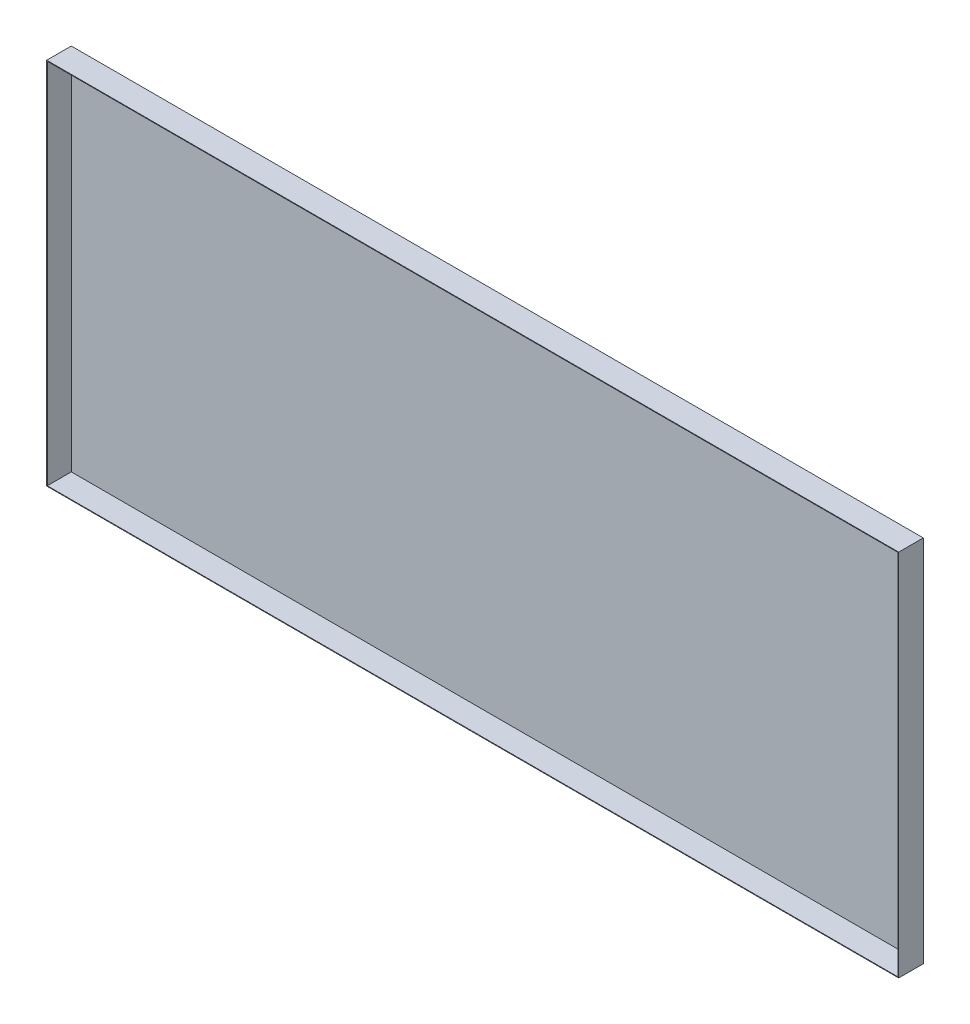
ISO-10303-21;
HEADER;
FILE_DESCRIPTION(('STEP AP214'),'2;1');
FILE_NAME('part.step','',(''),(''),'','','');
FILE_SCHEMA(('AUTOMOTIVE_DESIGN { 1 0 10303 214 1 1 1 1 }'));
ENDSEC;
DATA;
#1=APPLICATION_CONTEXT('core data for automotive mechanical design processes');
#2=APPLICATION_PROTOCOL_DEFINITION('international standard','automotive_design',2000,#1);
#3=PRODUCT_CONTEXT('',#1,'mechanical');
#4=PRODUCT('Part','Part','',(#3));
#5=PRODUCT_RELATED_PRODUCT_CATEGORY('part','',(#4));
#6=PRODUCT_DEFINITION_FORMATION('','',#4);
#7=PRODUCT_DEFINITION_CONTEXT('part definition',#1,'design');
#8=PRODUCT_DEFINITION('design','',#6,#7);
#9=PRODUCT_DEFINITION_SHAPE('','',#8);
#10=(LENGTH_UNIT() NAMED_UNIT(*) SI_UNIT(.MILLI.,.METRE.));
#11=(NAMED_UNIT(*) PLANE_ANGLE_UNIT() SI_UNIT($,.RADIAN.));
#12=(NAMED_UNIT(*) SI_UNIT($,.STERADIAN.) SOLID_ANGLE_UNIT());
#13=UNCERTAINTY_MEASURE_WITH_UNIT(LENGTH_MEASURE(1.E-05),#10,'distance_accuracy_value','');
#14=(GEOMETRIC_REPRESENTATION_CONTEXT(3) GLOBAL_UNCERTAINTY_ASSIGNED_CONTEXT((#13)) GLOBAL_UNIT_ASSIGNED_CONTEXT((#10,
#11,#12)) REPRESENTATION_CONTEXT('',''));
#15=CARTESIAN_POINT('',(0.,0.,0.));
#16=DIRECTION('',(0.,0.,1.));
#17=DIRECTION('',(1.,0.,0.));
#18=AXIS2_PLACEMENT_3D('',#15,#16,#17);
#19=CARTESIAN_POINT('',(693.,-600.,40.));
#20=DIRECTION('',(-1.,0.,0.));
#21=DIRECTION('',(0.,-1.,0.));
#22=AXIS2_PLACEMENT_3D('',#19,#20,#21);
#23=PLANE('',#22);
#24=DIRECTION('',(0.,1.,0.));
#25=VECTOR('',#24,1.);
#26=CARTESIAN_POINT('',(693.,-600.,0.));
#27=LINE('',#26,#25);
#28=CARTESIAN_POINT('',(693.,-600.,0.));
#29=VERTEX_POINT('',#28);
#30=CARTESIAN_POINT('',(693.,0.,0.));
#31=VERTEX_POINT('',#30);
#32=EDGE_CURVE('E447',#29,#31,#27,.T.);
#33=ORIENTED_EDGE('',*,*,#32,.T.);
#34=DIRECTION('',(0.,0.,-1.));
#35=VECTOR('',#34,1.);
#36=CARTESIAN_POINT('',(693.,0.,40.));
#37=LINE('',#36,#35);
#38=CARTESIAN_POINT('',(693.,0.,40.));
#39=VERTEX_POINT('',#38);
#40=EDGE_CURVE('E11',#39,#31,#37,.T.);
#41=ORIENTED_EDGE('',*,*,#40,.F.);
#42=DIRECTION('',(0.,1.,0.));
#43=VECTOR('',#42,1.);
#44=CARTESIAN_POINT('',(693.,-600.,40.));
#45=LINE('',#44,#43);
#46=CARTESIAN_POINT('',(693.,-600.,40.));
#47=VERTEX_POINT('',#46);
#48=EDGE_CURVE('E456',#47,#39,#45,.T.);
#49=ORIENTED_EDGE('',*,*,#48,.F.);
#50=DIRECTION('',(0.,0.,-1.));
#51=VECTOR('',#50,1.);
#52=CARTESIAN_POINT('',(693.,-600.,40.));
#53=LINE('',#52,#51);
#54=EDGE_CURVE('E463',#47,#29,#53,.T.);
#55=ORIENTED_EDGE('',*,*,#54,.T.);
#56=EDGE_LOOP('',(#33,#41,#49,#55));
#57=FACE_BOUND('',#56,.T.);
#58=ADVANCED_FACE('F348',(#57),#23,.F.);
#59=CARTESIAN_POINT('',(693.,0.,40.));
#60=DIRECTION('',(0.,-1.,0.));
#61=DIRECTION('',(1.,0.,0.));
#62=AXIS2_PLACEMENT_3D('',#59,#60,#61);
#63=PLANE('',#62);
#64=DIRECTION('',(-1.,0.,0.));
#65=VECTOR('',#64,1.);
#66=CARTESIAN_POINT('',(693.,0.,0.));
#67=LINE('',#66,#65);
#68=CARTESIAN_POINT('',(-693.,-1.76669334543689E-13,0.));
#69=VERTEX_POINT('',#68);
#70=EDGE_CURVE('E450',#31,#69,#67,.T.);
#71=ORIENTED_EDGE('',*,*,#70,.T.);
#72=DIRECTION('',(0.,0.,-1.));
#73=VECTOR('',#72,1.);
#74=CARTESIAN_POINT('',(-693.,-1.76669334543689E-13,40.));
#75=LINE('',#74,#73);
#76=CARTESIAN_POINT('',(-693.,-1.76669334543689E-13,40.));
#77=VERTEX_POINT('',#76);
#78=EDGE_CURVE('E355',#77,#69,#75,.T.);
#79=ORIENTED_EDGE('',*,*,#78,.F.);
#80=DIRECTION('',(-1.,0.,0.));
#81=VECTOR('',#80,1.);
#82=CARTESIAN_POINT('',(693.,0.,40.));
#83=LINE('',#82,#81);
#84=EDGE_CURVE('E458',#39,#77,#83,.T.);
#85=ORIENTED_EDGE('',*,*,#84,.F.);
#86=ORIENTED_EDGE('',*,*,#40,.T.);
#87=EDGE_LOOP('',(#71,#79,#85,#86));
#88=FACE_BOUND('',#87,.T.);
#89=ADVANCED_FACE('F486',(#88),#63,.F.);
#90=CARTESIAN_POINT('',(-693.,-600.,40.));
#91=DIRECTION('',(1.,0.,0.));
#92=DIRECTION('',(0.,0.,-1.));
#93=AXIS2_PLACEMENT_3D('',#90,#91,#92);
#94=PLANE('',#93);
#95=DIRECTION('',(0.,-1.,0.));
#96=VECTOR('',#95,1.);
#97=CARTESIAN_POINT('',(-693.,-600.,0.));
#98=LINE('',#97,#96);
#99=CARTESIAN_POINT('',(-693.,-600.,0.));
#100=VERTEX_POINT('',#99);
#101=EDGE_CURVE('E452',#69,#100,#98,.T.);
#102=ORIENTED_EDGE('',*,*,#101,.T.);
#103=DIRECTION('',(0.,0.,-1.));
#104=VECTOR('',#103,1.);
#105=CARTESIAN_POINT('',(-693.,-600.,40.));
#106=LINE('',#105,#104);
#107=CARTESIAN_POINT('',(-693.,-600.,40.));
#108=VERTEX_POINT('',#107);
#109=EDGE_CURVE('E466',#108,#100,#106,.T.);
#110=ORIENTED_EDGE('',*,*,#109,.F.);
#111=DIRECTION('',(0.,-1.,0.));
#112=VECTOR('',#111,1.);
#113=CARTESIAN_POINT('',(-693.,-600.,40.));
#114=LINE('',#113,#112);
#115=EDGE_CURVE('E460',#77,#108,#114,.T.);
#116=ORIENTED_EDGE('',*,*,#115,.F.);
#117=ORIENTED_EDGE('',*,*,#78,.T.);
#118=EDGE_LOOP('',(#102,#110,#116,#117));
#119=FACE_BOUND('',#118,.T.);
#120=ADVANCED_FACE('F473',(#119),#94,.F.);
#121=CARTESIAN_POINT('',(693.,-600.,40.));
#122=DIRECTION('',(0.,1.,0.));
#123=DIRECTION('',(-1.,0.,0.));
#124=AXIS2_PLACEMENT_3D('',#121,#122,#123);
#125=PLANE('',#124);
#126=DIRECTION('',(1.,0.,0.));
#127=VECTOR('',#126,1.);
#128=CARTESIAN_POINT('',(693.,-600.,0.));
#129=LINE('',#128,#127);
#130=EDGE_CURVE('E454',#100,#29,#129,.T.);
#131=ORIENTED_EDGE('',*,*,#130,.T.);
#132=ORIENTED_EDGE('',*,*,#54,.F.);
#133=DIRECTION('',(1.,0.,0.));
#134=VECTOR('',#133,1.);
#135=CARTESIAN_POINT('',(693.,-600.,40.));
#136=LINE('',#135,#134);
#137=EDGE_CURVE('E370',#108,#47,#136,.T.);
#138=ORIENTED_EDGE('',*,*,#137,.F.);
#139=ORIENTED_EDGE('',*,*,#109,.T.);
#140=EDGE_LOOP('',(#131,#132,#138,#139));
#141=FACE_BOUND('',#140,.T.);
#142=ADVANCED_FACE('F481',(#141),#125,.F.);
#143=CARTESIAN_POINT('',(693.,-600.,40.));
#144=DIRECTION('',(0.,0.,1.));
#145=DIRECTION('',(1.,0.,0.));
#146=AXIS2_PLACEMENT_3D('',#143,#144,#145);
#147=PLANE('',#146);
#148=DIRECTION('',(0.,1.,0.));
#149=VECTOR('',#148,1.);
#150=CARTESIAN_POINT('',(692.,-600.,40.));
#151=LINE('',#150,#149);
#152=CARTESIAN_POINT('',(692.,-599.,40.));
#153=VERTEX_POINT('',#152);
#154=CARTESIAN_POINT('',(692.,-1.00000000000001,40.));
#155=VERTEX_POINT('',#154);
#156=EDGE_CURVE('E436',#153,#155,#151,.T.);
#157=ORIENTED_EDGE('',*,*,#156,.F.);
#158=DIRECTION('',(1.,0.,0.));
#159=VECTOR('',#158,1.);
#160=CARTESIAN_POINT('',(693.,-599.,40.));
#161=LINE('',#160,#159);
#162=CARTESIAN_POINT('',(-692.,-599.,40.));
#163=VERTEX_POINT('',#162);
#164=EDGE_CURVE('E445',#163,#153,#161,.T.);
#165=ORIENTED_EDGE('',*,*,#164,.F.);
#166=DIRECTION('',(0.,-1.,0.));
#167=VECTOR('',#166,1.);
#168=CARTESIAN_POINT('',(-692.,-600.,40.));
#169=LINE('',#168,#167);
#170=CARTESIAN_POINT('',(-692.,-1.00000000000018,40.));
#171=VERTEX_POINT('',#170);
#172=EDGE_CURVE('E443',#171,#163,#169,.T.);
#173=ORIENTED_EDGE('',*,*,#172,.F.);
#174=DIRECTION('',(-1.,0.,0.));
#175=VECTOR('',#174,1.);
#176=CARTESIAN_POINT('',(693.,-1.00000000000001,40.));
#177=LINE('',#176,#175);
#178=EDGE_CURVE('E428',#155,#171,#177,.T.);
#179=ORIENTED_EDGE('',*,*,#178,.F.);
#180=EDGE_LOOP('',(#157,#165,#173,#179));
#181=FACE_BOUND('',#180,.T.);
#182=ORIENTED_EDGE('',*,*,#48,.T.);
#183=ORIENTED_EDGE('',*,*,#84,.T.);
#184=ORIENTED_EDGE('',*,*,#115,.T.);
#185=ORIENTED_EDGE('',*,*,#137,.T.);
#186=EDGE_LOOP('',(#182,#183,#184,#185));
#187=FACE_BOUND('',#186,.T.);
#188=ADVANCED_FACE('F485',(#181,#187),#147,.T.);
#189=CARTESIAN_POINT('',(693.,-600.,0.));
#190=DIRECTION('',(0.,0.,1.));
#191=DIRECTION('',(1.,0.,0.));
#192=AXIS2_PLACEMENT_3D('',#189,#190,#191);
#193=PLANE('',#192);
#194=ORIENTED_EDGE('',*,*,#32,.F.);
#195=ORIENTED_EDGE('',*,*,#130,.F.);
#196=ORIENTED_EDGE('',*,*,#101,.F.);
#197=ORIENTED_EDGE('',*,*,#70,.F.);
#198=EDGE_LOOP('',(#194,#195,#196,#197));
#199=FACE_BOUND('',#198,.T.);
#200=ADVANCED_FACE('F479',(#199),#193,.F.);
#201=CARTESIAN_POINT('',(692.,-600.,40.));
#202=DIRECTION('',(-1.,0.,0.));
#203=DIRECTION('',(0.,-1.,0.));
#204=AXIS2_PLACEMENT_3D('',#201,#202,#203);
#205=PLANE('',#204);
#206=DIRECTION('',(0.,1.,0.));
#207=VECTOR('',#206,1.);
#208=CARTESIAN_POINT('',(692.,-600.,1.));
#209=LINE('',#208,#207);
#210=CARTESIAN_POINT('',(692.,-599.,1.));
#211=VERTEX_POINT('',#210);
#212=CARTESIAN_POINT('',(692.,-1.00000000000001,1.));
#213=VERTEX_POINT('',#212);
#214=EDGE_CURVE('E419',#211,#213,#209,.T.);
#215=ORIENTED_EDGE('',*,*,#214,.F.);
#216=DIRECTION('',(0.,0.,-1.));
#217=VECTOR('',#216,1.);
#218=CARTESIAN_POINT('',(692.,-599.,40.));
#219=LINE('',#218,#217);
#220=EDGE_CURVE('E439',#153,#211,#219,.T.);
#221=ORIENTED_EDGE('',*,*,#220,.F.);
#222=ORIENTED_EDGE('',*,*,#156,.T.);
#223=DIRECTION('',(0.,0.,-1.));
#224=VECTOR('',#223,1.);
#225=CARTESIAN_POINT('',(692.,-1.00000000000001,40.));
#226=LINE('',#225,#224);
#227=EDGE_CURVE('E431',#155,#213,#226,.T.);
#228=ORIENTED_EDGE('',*,*,#227,.T.);
#229=EDGE_LOOP('',(#215,#221,#222,#228));
#230=FACE_BOUND('',#229,.T.);
#231=ADVANCED_FACE('F501',(#230),#205,.T.);
#232=CARTESIAN_POINT('',(693.,-1.00000000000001,40.));
#233=DIRECTION('',(0.,-1.,0.));
#234=DIRECTION('',(1.,0.,0.));
#235=AXIS2_PLACEMENT_3D('',#232,#233,#234);
#236=PLANE('',#235);
#237=DIRECTION('',(-1.,0.,0.));
#238=VECTOR('',#237,1.);
#239=CARTESIAN_POINT('',(693.,-1.00000000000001,1.));
#240=LINE('',#239,#238);
#241=CARTESIAN_POINT('',(-692.,-1.00000000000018,1.));
#242=VERTEX_POINT('',#241);
#243=EDGE_CURVE('E413',#213,#242,#240,.T.);
#244=ORIENTED_EDGE('',*,*,#243,.F.);
#245=ORIENTED_EDGE('',*,*,#227,.F.);
#246=ORIENTED_EDGE('',*,*,#178,.T.);
#247=DIRECTION('',(0.,0.,-1.));
#248=VECTOR('',#247,1.);
#249=CARTESIAN_POINT('',(-692.,-1.00000000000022,40.));
#250=LINE('',#249,#248);
#251=EDGE_CURVE('E425',#171,#242,#250,.T.);
#252=ORIENTED_EDGE('',*,*,#251,.T.);
#253=EDGE_LOOP('',(#244,#245,#246,#252));
#254=FACE_BOUND('',#253,.T.);
#255=ADVANCED_FACE('F426',(#254),#236,.T.);
#256=CARTESIAN_POINT('',(-692.,-600.,40.));
#257=DIRECTION('',(1.,0.,0.));
#258=DIRECTION('',(0.,0.,-1.));
#259=AXIS2_PLACEMENT_3D('',#256,#257,#258);
#260=PLANE('',#259);
#261=DIRECTION('',(0.,-1.,0.));
#262=VECTOR('',#261,1.);
#263=CARTESIAN_POINT('',(-692.,-600.,1.));
#264=LINE('',#263,#262);
#265=CARTESIAN_POINT('',(-692.,-599.,1.));
#266=VERTEX_POINT('',#265);
#267=EDGE_CURVE('E417',#242,#266,#264,.T.);
#268=ORIENTED_EDGE('',*,*,#267,.F.);
#269=ORIENTED_EDGE('',*,*,#251,.F.);
#270=ORIENTED_EDGE('',*,*,#172,.T.);
#271=DIRECTION('',(0.,0.,-1.));
#272=VECTOR('',#271,1.);
#273=CARTESIAN_POINT('',(-692.,-599.,40.));
#274=LINE('',#273,#272);
#275=EDGE_CURVE('E362',#163,#266,#274,.T.);
#276=ORIENTED_EDGE('',*,*,#275,.T.);
#277=EDGE_LOOP('',(#268,#269,#270,#276));
#278=FACE_BOUND('',#277,.T.);
#279=ADVANCED_FACE('F433',(#278),#260,.T.);
#280=CARTESIAN_POINT('',(693.,-599.,40.));
#281=DIRECTION('',(0.,1.,0.));
#282=DIRECTION('',(-1.,0.,0.));
#283=AXIS2_PLACEMENT_3D('',#280,#281,#282);
#284=PLANE('',#283);
#285=DIRECTION('',(1.,0.,0.));
#286=VECTOR('',#285,1.);
#287=CARTESIAN_POINT('',(693.,-599.,1.));
#288=LINE('',#287,#286);
#289=EDGE_CURVE('E434',#266,#211,#288,.T.);
#290=ORIENTED_EDGE('',*,*,#289,.F.);
#291=ORIENTED_EDGE('',*,*,#275,.F.);
#292=ORIENTED_EDGE('',*,*,#164,.T.);
#293=ORIENTED_EDGE('',*,*,#220,.T.);
#294=EDGE_LOOP('',(#290,#291,#292,#293));
#295=FACE_BOUND('',#294,.T.);
#296=ADVANCED_FACE('F504',(#295),#284,.T.);
#297=CARTESIAN_POINT('',(693.,-600.,1.));
#298=DIRECTION('',(0.,0.,1.));
#299=DIRECTION('',(1.,0.,0.));
#300=AXIS2_PLACEMENT_3D('',#297,#298,#299);
#301=PLANE('',#300);
#302=ORIENTED_EDGE('',*,*,#214,.T.);
#303=ORIENTED_EDGE('',*,*,#243,.T.);
#304=ORIENTED_EDGE('',*,*,#267,.T.);
#305=ORIENTED_EDGE('',*,*,#289,.T.);
#306=EDGE_LOOP('',(#302,#303,#304,#305));
#307=FACE_BOUND('',#306,.T.);
#308=ADVANCED_FACE('F415',(#307),#301,.T.);
#309=CLOSED_SHELL('',(#58,#89,#120,#142,#188,#200,#231,#255,#279,#296,#308));
#310=MANIFOLD_SOLID_BREP('B2',#309);
#311=ADVANCED_BREP_SHAPE_REPRESENTATION('',(#18,#310),#14);
#312=SHAPE_DEFINITION_REPRESENTATION(#9,#311);
ENDSEC;
END-ISO-10303-21;
